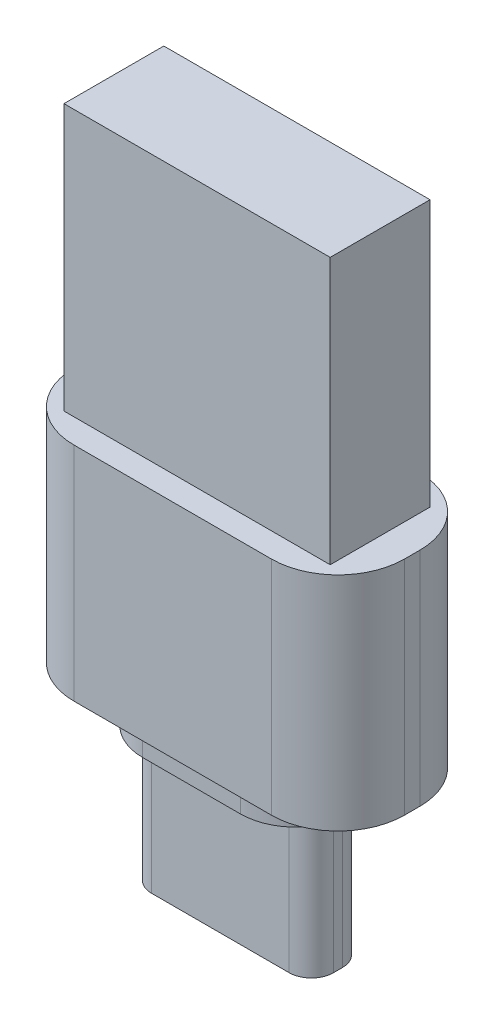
ISO-10303-21;
HEADER;
FILE_DESCRIPTION(('STEP AP214'),'2;1');
FILE_NAME('part.step','',(''),(''),'','','');
FILE_SCHEMA(('AUTOMOTIVE_DESIGN { 1 0 10303 214 1 1 1 1 }'));
ENDSEC;
DATA;
#1=APPLICATION_CONTEXT('core data for automotive mechanical design processes');
#2=APPLICATION_PROTOCOL_DEFINITION('international standard','automotive_design',2000,#1);
#3=PRODUCT_CONTEXT('',#1,'mechanical');
#4=PRODUCT('Part','Part','',(#3));
#5=PRODUCT_RELATED_PRODUCT_CATEGORY('part','',(#4));
#6=PRODUCT_DEFINITION_FORMATION('','',#4);
#7=PRODUCT_DEFINITION_CONTEXT('part definition',#1,'design');
#8=PRODUCT_DEFINITION('design','',#6,#7);
#9=PRODUCT_DEFINITION_SHAPE('','',#8);
#10=(LENGTH_UNIT() NAMED_UNIT(*) SI_UNIT(.MILLI.,.METRE.));
#11=(NAMED_UNIT(*) PLANE_ANGLE_UNIT() SI_UNIT($,.RADIAN.));
#12=(NAMED_UNIT(*) SI_UNIT($,.STERADIAN.) SOLID_ANGLE_UNIT());
#13=UNCERTAINTY_MEASURE_WITH_UNIT(LENGTH_MEASURE(1.E-05),#10,'distance_accuracy_value','');
#14=(GEOMETRIC_REPRESENTATION_CONTEXT(3) GLOBAL_UNCERTAINTY_ASSIGNED_CONTEXT((#13)) GLOBAL_UNIT_ASSIGNED_CONTEXT((#10,
#11,#12)) REPRESENTATION_CONTEXT('',''));
#15=CARTESIAN_POINT('',(0.,0.,0.));
#16=DIRECTION('',(0.,0.,1.));
#17=DIRECTION('',(1.,0.,0.));
#18=AXIS2_PLACEMENT_3D('',#15,#16,#17);
#19=CARTESIAN_POINT('',(0.,-1.5,0.));
#20=DIRECTION('',(0.,1.,0.));
#21=DIRECTION('',(0.,0.,1.));
#22=AXIS2_PLACEMENT_3D('',#19,#20,#21);
#23=PLANE('',#22);
#24=CARTESIAN_POINT('',(-2.2,-1.5,0.));
#25=DIRECTION('',(0.,1.,0.));
#26=DIRECTION('',(0.,0.,1.));
#27=AXIS2_PLACEMENT_3D('',#24,#25,#26);
#28=CIRCLE('',#27,2.5);
#29=CARTESIAN_POINT('',(-2.2,-1.5,2.5));
#30=VERTEX_POINT('',#29);
#31=CARTESIAN_POINT('',(-4.7,-1.5,0.));
#32=VERTEX_POINT('',#31);
#33=EDGE_CURVE('E308',#30,#32,#28,.F.);
#34=ORIENTED_EDGE('',*,*,#33,.T.);
#35=CARTESIAN_POINT('',(-2.2,-1.5,0.));
#36=DIRECTION('',(0.,1.,0.));
#37=DIRECTION('',(0.,0.,1.));
#38=AXIS2_PLACEMENT_3D('',#35,#36,#37);
#39=CIRCLE('',#38,2.5);
#40=CARTESIAN_POINT('',(-2.2,-1.5,-2.5));
#41=VERTEX_POINT('',#40);
#42=EDGE_CURVE('E310',#32,#41,#39,.F.);
#43=ORIENTED_EDGE('',*,*,#42,.T.);
#44=DIRECTION('',(1.,0.,0.));
#45=VECTOR('',#44,1.);
#46=CARTESIAN_POINT('',(4.7,-1.5,-2.5));
#47=LINE('',#46,#45);
#48=CARTESIAN_POINT('',(2.2,-1.5,-2.5));
#49=VERTEX_POINT('',#48);
#50=EDGE_CURVE('E400',#41,#49,#47,.T.);
#51=ORIENTED_EDGE('',*,*,#50,.T.);
#52=CARTESIAN_POINT('',(2.2,-1.5,0.));
#53=DIRECTION('',(0.,1.,0.));
#54=DIRECTION('',(0.,0.,1.));
#55=AXIS2_PLACEMENT_3D('',#52,#53,#54);
#56=CIRCLE('',#55,2.5);
#57=CARTESIAN_POINT('',(4.7,-1.5,0.));
#58=VERTEX_POINT('',#57);
#59=EDGE_CURVE('E304',#49,#58,#56,.F.);
#60=ORIENTED_EDGE('',*,*,#59,.T.);
#61=CARTESIAN_POINT('',(2.2,-1.5,0.));
#62=DIRECTION('',(0.,1.,0.));
#63=DIRECTION('',(0.,0.,1.));
#64=AXIS2_PLACEMENT_3D('',#61,#62,#63);
#65=CIRCLE('',#64,2.5);
#66=CARTESIAN_POINT('',(2.2,-1.5,2.5));
#67=VERTEX_POINT('',#66);
#68=EDGE_CURVE('E306',#58,#67,#65,.F.);
#69=ORIENTED_EDGE('',*,*,#68,.T.);
#70=DIRECTION('',(-1.,0.,0.));
#71=VECTOR('',#70,1.);
#72=CARTESIAN_POINT('',(4.7,-1.5,2.5));
#73=LINE('',#72,#71);
#74=EDGE_CURVE('E403',#67,#30,#73,.T.);
#75=ORIENTED_EDGE('',*,*,#74,.T.);
#76=EDGE_LOOP('',(#34,#43,#51,#60,#69,#75));
#77=FACE_BOUND('',#76,.T.);
#78=DIRECTION('',(0.,0.,-1.));
#79=VECTOR('',#78,1.);
#80=CARTESIAN_POINT('',(-4.1,-1.5,1.2));
#81=LINE('',#80,#79);
#82=CARTESIAN_POINT('',(-4.1,-1.5,0.199999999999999));
#83=VERTEX_POINT('',#82);
#84=CARTESIAN_POINT('',(-4.1,-1.5,-0.200000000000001));
#85=VERTEX_POINT('',#84);
#86=EDGE_CURVE('E329',#83,#85,#81,.T.);
#87=ORIENTED_EDGE('',*,*,#86,.F.);
#88=CARTESIAN_POINT('',(-3.1,-1.5,0.199999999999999));
#89=DIRECTION('',(0.,1.,0.));
#90=DIRECTION('',(0.,0.,1.));
#91=AXIS2_PLACEMENT_3D('',#88,#89,#90);
#92=CIRCLE('',#91,1.);
#93=CARTESIAN_POINT('',(-3.1,-1.5,1.2));
#94=VERTEX_POINT('',#93);
#95=EDGE_CURVE('E45',#83,#94,#92,.T.);
#96=ORIENTED_EDGE('',*,*,#95,.T.);
#97=DIRECTION('',(-1.,0.,0.));
#98=VECTOR('',#97,1.);
#99=CARTESIAN_POINT('',(4.1,-1.5,1.2));
#100=LINE('',#99,#98);
#101=CARTESIAN_POINT('',(3.1,-1.5,1.2));
#102=VERTEX_POINT('',#101);
#103=EDGE_CURVE('E364',#102,#94,#100,.T.);
#104=ORIENTED_EDGE('',*,*,#103,.F.);
#105=CARTESIAN_POINT('',(3.1,-1.5,0.2));
#106=DIRECTION('',(0.,1.,0.));
#107=DIRECTION('',(0.,0.,1.));
#108=AXIS2_PLACEMENT_3D('',#105,#106,#107);
#109=CIRCLE('',#108,1.);
#110=CARTESIAN_POINT('',(4.1,-1.5,0.2));
#111=VERTEX_POINT('',#110);
#112=EDGE_CURVE('E361',#102,#111,#109,.T.);
#113=ORIENTED_EDGE('',*,*,#112,.T.);
#114=DIRECTION('',(0.,0.,1.));
#115=VECTOR('',#114,1.);
#116=CARTESIAN_POINT('',(4.1,-1.5,1.2));
#117=LINE('',#116,#115);
#118=CARTESIAN_POINT('',(4.1,-1.5,-0.2));
#119=VERTEX_POINT('',#118);
#120=EDGE_CURVE('E371',#119,#111,#117,.T.);
#121=ORIENTED_EDGE('',*,*,#120,.F.);
#122=CARTESIAN_POINT('',(3.1,-1.5,-0.2));
#123=DIRECTION('',(0.,1.,0.));
#124=DIRECTION('',(0.,0.,1.));
#125=AXIS2_PLACEMENT_3D('',#122,#123,#124);
#126=CIRCLE('',#125,1.);
#127=CARTESIAN_POINT('',(3.1,-1.5,-1.2));
#128=VERTEX_POINT('',#127);
#129=EDGE_CURVE('E359',#119,#128,#126,.T.);
#130=ORIENTED_EDGE('',*,*,#129,.T.);
#131=DIRECTION('',(1.,0.,0.));
#132=VECTOR('',#131,1.);
#133=CARTESIAN_POINT('',(4.1,-1.5,-1.2));
#134=LINE('',#133,#132);
#135=CARTESIAN_POINT('',(-3.1,-1.5,-1.2));
#136=VERTEX_POINT('',#135);
#137=EDGE_CURVE('E395',#136,#128,#134,.T.);
#138=ORIENTED_EDGE('',*,*,#137,.F.);
#139=CARTESIAN_POINT('',(-3.1,-1.5,-0.2));
#140=DIRECTION('',(0.,1.,0.));
#141=DIRECTION('',(0.,0.,1.));
#142=AXIS2_PLACEMENT_3D('',#139,#140,#141);
#143=CIRCLE('',#142,1.);
#144=EDGE_CURVE('E11',#136,#85,#143,.T.);
#145=ORIENTED_EDGE('',*,*,#144,.T.);
#146=EDGE_LOOP('',(#87,#96,#104,#113,#121,#130,#138,#145));
#147=FACE_BOUND('',#146,.T.);
#148=ADVANCED_FACE('F37',(#77,#147),#23,.F.);
#149=CARTESIAN_POINT('',(0.,10.,0.));
#150=DIRECTION('',(0.,-1.,0.));
#151=DIRECTION('',(0.,0.,-1.));
#152=AXIS2_PLACEMENT_3D('',#149,#150,#151);
#153=PLANE('',#152);
#154=DIRECTION('',(1.,0.,0.));
#155=VECTOR('',#154,1.);
#156=CARTESIAN_POINT('',(-7.44999999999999,10.,3.35));
#157=LINE('',#156,#155);
#158=CARTESIAN_POINT('',(-4.44999999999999,10.,3.35));
#159=VERTEX_POINT('',#158);
#160=CARTESIAN_POINT('',(4.45,10.,3.35));
#161=VERTEX_POINT('',#160);
#162=EDGE_CURVE('E253',#159,#161,#157,.T.);
#163=ORIENTED_EDGE('',*,*,#162,.T.);
#164=CARTESIAN_POINT('',(4.45,10.,0.35));
#165=DIRECTION('',(0.,-1.,0.));
#166=DIRECTION('',(0.,0.,-1.));
#167=AXIS2_PLACEMENT_3D('',#164,#165,#166);
#168=CIRCLE('',#167,3.);
#169=CARTESIAN_POINT('',(7.45,10.,0.35));
#170=VERTEX_POINT('',#169);
#171=EDGE_CURVE('E287',#161,#170,#168,.F.);
#172=ORIENTED_EDGE('',*,*,#171,.T.);
#173=DIRECTION('',(0.,0.,-1.));
#174=VECTOR('',#173,1.);
#175=CARTESIAN_POINT('',(7.45,10.,3.35));
#176=LINE('',#175,#174);
#177=CARTESIAN_POINT('',(7.45,10.,-0.35));
#178=VERTEX_POINT('',#177);
#179=EDGE_CURVE('E243',#170,#178,#176,.T.);
#180=ORIENTED_EDGE('',*,*,#179,.T.);
#181=CARTESIAN_POINT('',(4.45,10.,-0.35));
#182=DIRECTION('',(0.,-1.,0.));
#183=DIRECTION('',(0.,0.,-1.));
#184=AXIS2_PLACEMENT_3D('',#181,#182,#183);
#185=CIRCLE('',#184,3.);
#186=CARTESIAN_POINT('',(4.45,10.,-3.35));
#187=VERTEX_POINT('',#186);
#188=EDGE_CURVE('E281',#178,#187,#185,.F.);
#189=ORIENTED_EDGE('',*,*,#188,.T.);
#190=DIRECTION('',(-1.,0.,0.));
#191=VECTOR('',#190,1.);
#192=CARTESIAN_POINT('',(-7.44999999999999,10.,-3.35));
#193=LINE('',#192,#191);
#194=CARTESIAN_POINT('',(-4.44999999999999,10.,-3.35));
#195=VERTEX_POINT('',#194);
#196=EDGE_CURVE('E246',#187,#195,#193,.T.);
#197=ORIENTED_EDGE('',*,*,#196,.T.);
#198=CARTESIAN_POINT('',(-4.44999999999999,10.,-0.35));
#199=DIRECTION('',(0.,-1.,0.));
#200=DIRECTION('',(0.,0.,-1.));
#201=AXIS2_PLACEMENT_3D('',#198,#199,#200);
#202=CIRCLE('',#201,3.);
#203=CARTESIAN_POINT('',(-7.44999999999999,10.,-0.35));
#204=VERTEX_POINT('',#203);
#205=EDGE_CURVE('E283',#195,#204,#202,.F.);
#206=ORIENTED_EDGE('',*,*,#205,.T.);
#207=DIRECTION('',(0.,0.,1.));
#208=VECTOR('',#207,1.);
#209=CARTESIAN_POINT('',(-7.44999999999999,10.,3.35));
#210=LINE('',#209,#208);
#211=CARTESIAN_POINT('',(-7.44999999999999,10.,0.35));
#212=VERTEX_POINT('',#211);
#213=EDGE_CURVE('E250',#204,#212,#210,.T.);
#214=ORIENTED_EDGE('',*,*,#213,.T.);
#215=CARTESIAN_POINT('',(-4.44999999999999,10.,0.35));
#216=DIRECTION('',(0.,-1.,0.));
#217=DIRECTION('',(0.,0.,-1.));
#218=AXIS2_PLACEMENT_3D('',#215,#216,#217);
#219=CIRCLE('',#218,3.);
#220=EDGE_CURVE('E285',#212,#159,#219,.F.);
#221=ORIENTED_EDGE('',*,*,#220,.T.);
#222=EDGE_LOOP('',(#163,#172,#180,#189,#197,#206,#214,#221));
#223=FACE_BOUND('',#222,.T.);
#224=DIRECTION('',(0.,0.,-1.));
#225=VECTOR('',#224,1.);
#226=CARTESIAN_POINT('',(6.,10.,2.25));
#227=LINE('',#226,#225);
#228=CARTESIAN_POINT('',(6.,10.,2.25));
#229=VERTEX_POINT('',#228);
#230=CARTESIAN_POINT('',(6.,10.,-2.25000000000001));
#231=VERTEX_POINT('',#230);
#232=EDGE_CURVE('E233',#229,#231,#227,.T.);
#233=ORIENTED_EDGE('',*,*,#232,.F.);
#234=DIRECTION('',(1.,0.,0.));
#235=VECTOR('',#234,1.);
#236=CARTESIAN_POINT('',(-6.,10.,2.25));
#237=LINE('',#236,#235);
#238=CARTESIAN_POINT('',(-6.,10.,2.25));
#239=VERTEX_POINT('',#238);
#240=EDGE_CURVE('E230',#239,#229,#237,.T.);
#241=ORIENTED_EDGE('',*,*,#240,.F.);
#242=DIRECTION('',(0.,0.,1.));
#243=VECTOR('',#242,1.);
#244=CARTESIAN_POINT('',(-6.,10.,2.25));
#245=LINE('',#244,#243);
#246=CARTESIAN_POINT('',(-6.,10.,-2.25000000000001));
#247=VERTEX_POINT('',#246);
#248=EDGE_CURVE('E417',#247,#239,#245,.T.);
#249=ORIENTED_EDGE('',*,*,#248,.F.);
#250=DIRECTION('',(-1.,0.,0.));
#251=VECTOR('',#250,1.);
#252=CARTESIAN_POINT('',(-6.,10.,-2.25000000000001));
#253=LINE('',#252,#251);
#254=EDGE_CURVE('E415',#231,#247,#253,.T.);
#255=ORIENTED_EDGE('',*,*,#254,.F.);
#256=EDGE_LOOP('',(#233,#241,#249,#255));
#257=FACE_BOUND('',#256,.T.);
#258=ADVANCED_FACE('F429',(#223,#257),#153,.F.);
#259=CARTESIAN_POINT('',(7.45,10.,3.35));
#260=DIRECTION('',(-1.,0.,0.));
#261=DIRECTION('',(0.,0.,1.));
#262=AXIS2_PLACEMENT_3D('',#259,#260,#261);
#263=PLANE('',#262);
#264=ORIENTED_EDGE('',*,*,#179,.F.);
#265=DIRECTION('',(0.,-1.,0.));
#266=VECTOR('',#265,1.);
#267=CARTESIAN_POINT('',(7.45,10.,0.35));
#268=LINE('',#267,#266);
#269=CARTESIAN_POINT('',(7.45,0.,0.35));
#270=VERTEX_POINT('',#269);
#271=EDGE_CURVE('E265',#170,#270,#268,.T.);
#272=ORIENTED_EDGE('',*,*,#271,.T.);
#273=DIRECTION('',(0.,0.,-1.));
#274=VECTOR('',#273,1.);
#275=CARTESIAN_POINT('',(7.45,0.,3.35));
#276=LINE('',#275,#274);
#277=CARTESIAN_POINT('',(7.45,0.,-0.35));
#278=VERTEX_POINT('',#277);
#279=EDGE_CURVE('E234',#270,#278,#276,.T.);
#280=ORIENTED_EDGE('',*,*,#279,.T.);
#281=DIRECTION('',(0.,-1.,0.));
#282=VECTOR('',#281,1.);
#283=CARTESIAN_POINT('',(7.45,10.,-0.35));
#284=LINE('',#283,#282);
#285=EDGE_CURVE('E255',#278,#178,#284,.F.);
#286=ORIENTED_EDGE('',*,*,#285,.T.);
#287=EDGE_LOOP('',(#264,#272,#280,#286));
#288=FACE_BOUND('',#287,.T.);
#289=ADVANCED_FACE('F431',(#288),#263,.F.);
#290=CARTESIAN_POINT('',(-7.44999999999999,10.,-3.35));
#291=DIRECTION('',(0.,0.,1.));
#292=DIRECTION('',(1.,0.,0.));
#293=AXIS2_PLACEMENT_3D('',#290,#291,#292);
#294=PLANE('',#293);
#295=DIRECTION('',(-1.,0.,0.));
#296=VECTOR('',#295,1.);
#297=CARTESIAN_POINT('',(-7.44999999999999,0.,-3.35));
#298=LINE('',#297,#296);
#299=CARTESIAN_POINT('',(4.45,0.,-3.35));
#300=VERTEX_POINT('',#299);
#301=CARTESIAN_POINT('',(-4.44999999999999,0.,-3.35));
#302=VERTEX_POINT('',#301);
#303=EDGE_CURVE('E237',#300,#302,#298,.T.);
#304=ORIENTED_EDGE('',*,*,#303,.T.);
#305=DIRECTION('',(0.,-1.,0.));
#306=VECTOR('',#305,1.);
#307=CARTESIAN_POINT('',(-4.44999999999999,10.,-3.35));
#308=LINE('',#307,#306);
#309=EDGE_CURVE('E297',#302,#195,#308,.F.);
#310=ORIENTED_EDGE('',*,*,#309,.T.);
#311=ORIENTED_EDGE('',*,*,#196,.F.);
#312=DIRECTION('',(0.,-1.,0.));
#313=VECTOR('',#312,1.);
#314=CARTESIAN_POINT('',(4.45,10.,-3.35));
#315=LINE('',#314,#313);
#316=EDGE_CURVE('E294',#187,#300,#315,.T.);
#317=ORIENTED_EDGE('',*,*,#316,.T.);
#318=EDGE_LOOP('',(#304,#310,#311,#317));
#319=FACE_BOUND('',#318,.T.);
#320=ADVANCED_FACE('F438',(#319),#294,.F.);
#321=CARTESIAN_POINT('',(-7.44999999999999,10.,3.35));
#322=DIRECTION('',(1.,0.,0.));
#323=DIRECTION('',(0.,0.,-1.));
#324=AXIS2_PLACEMENT_3D('',#321,#322,#323);
#325=PLANE('',#324);
#326=DIRECTION('',(0.,0.,1.));
#327=VECTOR('',#326,1.);
#328=CARTESIAN_POINT('',(-7.44999999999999,0.,3.35));
#329=LINE('',#328,#327);
#330=CARTESIAN_POINT('',(-7.44999999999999,0.,-0.35));
#331=VERTEX_POINT('',#330);
#332=CARTESIAN_POINT('',(-7.44999999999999,0.,0.35));
#333=VERTEX_POINT('',#332);
#334=EDGE_CURVE('E259',#331,#333,#329,.T.);
#335=ORIENTED_EDGE('',*,*,#334,.T.);
#336=DIRECTION('',(0.,-1.,0.));
#337=VECTOR('',#336,1.);
#338=CARTESIAN_POINT('',(-7.44999999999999,10.,0.35));
#339=LINE('',#338,#337);
#340=EDGE_CURVE('E292',#333,#212,#339,.F.);
#341=ORIENTED_EDGE('',*,*,#340,.T.);
#342=ORIENTED_EDGE('',*,*,#213,.F.);
#343=DIRECTION('',(0.,-1.,0.));
#344=VECTOR('',#343,1.);
#345=CARTESIAN_POINT('',(-7.44999999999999,10.,-0.35));
#346=LINE('',#345,#344);
#347=EDGE_CURVE('E289',#204,#331,#346,.T.);
#348=ORIENTED_EDGE('',*,*,#347,.T.);
#349=EDGE_LOOP('',(#335,#341,#342,#348));
#350=FACE_BOUND('',#349,.T.);
#351=ADVANCED_FACE('F453',(#350),#325,.F.);
#352=CARTESIAN_POINT('',(-7.44999999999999,10.,3.35));
#353=DIRECTION('',(0.,0.,-1.));
#354=DIRECTION('',(-1.,0.,0.));
#355=AXIS2_PLACEMENT_3D('',#352,#353,#354);
#356=PLANE('',#355);
#357=DIRECTION('',(1.,0.,0.));
#358=VECTOR('',#357,1.);
#359=CARTESIAN_POINT('',(-7.44999999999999,0.,3.35));
#360=LINE('',#359,#358);
#361=CARTESIAN_POINT('',(-4.44999999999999,0.,3.35));
#362=VERTEX_POINT('',#361);
#363=CARTESIAN_POINT('',(4.45,0.,3.35));
#364=VERTEX_POINT('',#363);
#365=EDGE_CURVE('E247',#362,#364,#360,.T.);
#366=ORIENTED_EDGE('',*,*,#365,.T.);
#367=DIRECTION('',(0.,-1.,0.));
#368=VECTOR('',#367,1.);
#369=CARTESIAN_POINT('',(4.45,10.,3.35));
#370=LINE('',#369,#368);
#371=EDGE_CURVE('E279',#364,#161,#370,.F.);
#372=ORIENTED_EDGE('',*,*,#371,.T.);
#373=ORIENTED_EDGE('',*,*,#162,.F.);
#374=DIRECTION('',(0.,-1.,0.));
#375=VECTOR('',#374,1.);
#376=CARTESIAN_POINT('',(-4.44999999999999,10.,3.35));
#377=LINE('',#376,#375);
#378=EDGE_CURVE('E276',#159,#362,#377,.T.);
#379=ORIENTED_EDGE('',*,*,#378,.T.);
#380=EDGE_LOOP('',(#366,#372,#373,#379));
#381=FACE_BOUND('',#380,.T.);
#382=ADVANCED_FACE('F449',(#381),#356,.F.);
#383=CARTESIAN_POINT('',(0.,0.,0.));
#384=DIRECTION('',(0.,-1.,0.));
#385=DIRECTION('',(0.,0.,-1.));
#386=AXIS2_PLACEMENT_3D('',#383,#384,#385);
#387=PLANE('',#386);
#388=CARTESIAN_POINT('',(-2.2,0.,0.));
#389=DIRECTION('',(0.,-1.,0.));
#390=DIRECTION('',(0.,0.,-1.));
#391=AXIS2_PLACEMENT_3D('',#388,#389,#390);
#392=CIRCLE('',#391,2.5);
#393=CARTESIAN_POINT('',(-2.2,0.,-2.5));
#394=VERTEX_POINT('',#393);
#395=CARTESIAN_POINT('',(-4.7,0.,0.));
#396=VERTEX_POINT('',#395);
#397=EDGE_CURVE('E317',#394,#396,#392,.F.);
#398=ORIENTED_EDGE('',*,*,#397,.T.);
#399=CARTESIAN_POINT('',(-2.2,0.,0.));
#400=DIRECTION('',(0.,-1.,0.));
#401=DIRECTION('',(0.,0.,-1.));
#402=AXIS2_PLACEMENT_3D('',#399,#400,#401);
#403=CIRCLE('',#402,2.5);
#404=CARTESIAN_POINT('',(-2.2,0.,2.5));
#405=VERTEX_POINT('',#404);
#406=EDGE_CURVE('E319',#396,#405,#403,.F.);
#407=ORIENTED_EDGE('',*,*,#406,.T.);
#408=DIRECTION('',(-1.,0.,0.));
#409=VECTOR('',#408,1.);
#410=CARTESIAN_POINT('',(4.7,0.,2.5));
#411=LINE('',#410,#409);
#412=CARTESIAN_POINT('',(2.2,0.,2.5));
#413=VERTEX_POINT('',#412);
#414=EDGE_CURVE('E404',#413,#405,#411,.T.);
#415=ORIENTED_EDGE('',*,*,#414,.F.);
#416=CARTESIAN_POINT('',(2.2,0.,0.));
#417=DIRECTION('',(0.,-1.,0.));
#418=DIRECTION('',(0.,0.,-1.));
#419=AXIS2_PLACEMENT_3D('',#416,#417,#418);
#420=CIRCLE('',#419,2.5);
#421=CARTESIAN_POINT('',(4.7,0.,0.));
#422=VERTEX_POINT('',#421);
#423=EDGE_CURVE('E321',#413,#422,#420,.F.);
#424=ORIENTED_EDGE('',*,*,#423,.T.);
#425=CARTESIAN_POINT('',(2.2,0.,0.));
#426=DIRECTION('',(0.,-1.,0.));
#427=DIRECTION('',(0.,0.,-1.));
#428=AXIS2_PLACEMENT_3D('',#425,#426,#427);
#429=CIRCLE('',#428,2.5);
#430=CARTESIAN_POINT('',(2.2,0.,-2.5));
#431=VERTEX_POINT('',#430);
#432=EDGE_CURVE('E323',#422,#431,#429,.F.);
#433=ORIENTED_EDGE('',*,*,#432,.T.);
#434=DIRECTION('',(1.,0.,0.));
#435=VECTOR('',#434,1.);
#436=CARTESIAN_POINT('',(4.7,0.,-2.5));
#437=LINE('',#436,#435);
#438=EDGE_CURVE('E393',#394,#431,#437,.T.);
#439=ORIENTED_EDGE('',*,*,#438,.F.);
#440=EDGE_LOOP('',(#398,#407,#415,#424,#433,#439));
#441=FACE_BOUND('',#440,.T.);
#442=ORIENTED_EDGE('',*,*,#279,.F.);
#443=CARTESIAN_POINT('',(4.45,0.,0.35));
#444=DIRECTION('',(0.,-1.,0.));
#445=DIRECTION('',(0.,0.,-1.));
#446=AXIS2_PLACEMENT_3D('',#443,#444,#445);
#447=CIRCLE('',#446,3.);
#448=EDGE_CURVE('E274',#270,#364,#447,.T.);
#449=ORIENTED_EDGE('',*,*,#448,.T.);
#450=ORIENTED_EDGE('',*,*,#365,.F.);
#451=CARTESIAN_POINT('',(-4.44999999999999,0.,0.35));
#452=DIRECTION('',(0.,-1.,0.));
#453=DIRECTION('',(0.,0.,-1.));
#454=AXIS2_PLACEMENT_3D('',#451,#452,#453);
#455=CIRCLE('',#454,3.);
#456=EDGE_CURVE('E272',#362,#333,#455,.T.);
#457=ORIENTED_EDGE('',*,*,#456,.T.);
#458=ORIENTED_EDGE('',*,*,#334,.F.);
#459=CARTESIAN_POINT('',(-4.44999999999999,0.,-0.35));
#460=DIRECTION('',(0.,-1.,0.));
#461=DIRECTION('',(0.,0.,-1.));
#462=AXIS2_PLACEMENT_3D('',#459,#460,#461);
#463=CIRCLE('',#462,3.);
#464=EDGE_CURVE('E270',#331,#302,#463,.T.);
#465=ORIENTED_EDGE('',*,*,#464,.T.);
#466=ORIENTED_EDGE('',*,*,#303,.F.);
#467=CARTESIAN_POINT('',(4.45,0.,-0.35));
#468=DIRECTION('',(0.,-1.,0.));
#469=DIRECTION('',(0.,0.,-1.));
#470=AXIS2_PLACEMENT_3D('',#467,#468,#469);
#471=CIRCLE('',#470,3.);
#472=EDGE_CURVE('E268',#300,#278,#471,.T.);
#473=ORIENTED_EDGE('',*,*,#472,.T.);
#474=EDGE_LOOP('',(#442,#449,#450,#457,#458,#465,#466,#473));
#475=FACE_BOUND('',#474,.T.);
#476=ADVANCED_FACE('F446',(#441,#475),#387,.T.);
#477=CARTESIAN_POINT('',(6.,22.,2.25));
#478=DIRECTION('',(-1.,0.,0.));
#479=DIRECTION('',(0.,0.,1.));
#480=AXIS2_PLACEMENT_3D('',#477,#478,#479);
#481=PLANE('',#480);
#482=ORIENTED_EDGE('',*,*,#232,.T.);
#483=DIRECTION('',(0.,-1.,0.));
#484=VECTOR('',#483,1.);
#485=CARTESIAN_POINT('',(6.,22.,-2.25000000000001));
#486=LINE('',#485,#484);
#487=CARTESIAN_POINT('',(6.,22.,-2.25000000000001));
#488=VERTEX_POINT('',#487);
#489=EDGE_CURVE('E214',#488,#231,#486,.T.);
#490=ORIENTED_EDGE('',*,*,#489,.F.);
#491=DIRECTION('',(0.,0.,-1.));
#492=VECTOR('',#491,1.);
#493=CARTESIAN_POINT('',(6.,22.,2.25));
#494=LINE('',#493,#492);
#495=CARTESIAN_POINT('',(6.,22.,2.25));
#496=VERTEX_POINT('',#495);
#497=EDGE_CURVE('E221',#496,#488,#494,.T.);
#498=ORIENTED_EDGE('',*,*,#497,.F.);
#499=DIRECTION('',(0.,-1.,0.));
#500=VECTOR('',#499,1.);
#501=CARTESIAN_POINT('',(6.,22.,2.25));
#502=LINE('',#501,#500);
#503=EDGE_CURVE('E413',#496,#229,#502,.T.);
#504=ORIENTED_EDGE('',*,*,#503,.T.);
#505=EDGE_LOOP('',(#482,#490,#498,#504));
#506=FACE_BOUND('',#505,.T.);
#507=ADVANCED_FACE('F232',(#506),#481,.F.);
#508=CARTESIAN_POINT('',(-6.,22.,-2.25000000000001));
#509=DIRECTION('',(0.,0.,1.));
#510=DIRECTION('',(1.,0.,0.));
#511=AXIS2_PLACEMENT_3D('',#508,#509,#510);
#512=PLANE('',#511);
#513=ORIENTED_EDGE('',*,*,#254,.T.);
#514=DIRECTION('',(0.,-1.,0.));
#515=VECTOR('',#514,1.);
#516=CARTESIAN_POINT('',(-6.,22.,-2.25000000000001));
#517=LINE('',#516,#515);
#518=CARTESIAN_POINT('',(-6.,22.,-2.25000000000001));
#519=VERTEX_POINT('',#518);
#520=EDGE_CURVE('E217',#519,#247,#517,.T.);
#521=ORIENTED_EDGE('',*,*,#520,.F.);
#522=DIRECTION('',(-1.,0.,0.));
#523=VECTOR('',#522,1.);
#524=CARTESIAN_POINT('',(-6.,22.,-2.25000000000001));
#525=LINE('',#524,#523);
#526=EDGE_CURVE('E209',#488,#519,#525,.T.);
#527=ORIENTED_EDGE('',*,*,#526,.F.);
#528=ORIENTED_EDGE('',*,*,#489,.T.);
#529=EDGE_LOOP('',(#513,#521,#527,#528));
#530=FACE_BOUND('',#529,.T.);
#531=ADVANCED_FACE('F212',(#530),#512,.F.);
#532=CARTESIAN_POINT('',(-6.,22.,2.25));
#533=DIRECTION('',(1.,0.,0.));
#534=DIRECTION('',(0.,0.,-1.));
#535=AXIS2_PLACEMENT_3D('',#532,#533,#534);
#536=PLANE('',#535);
#537=ORIENTED_EDGE('',*,*,#248,.T.);
#538=DIRECTION('',(0.,-1.,0.));
#539=VECTOR('',#538,1.);
#540=CARTESIAN_POINT('',(-6.,22.,2.25));
#541=LINE('',#540,#539);
#542=CARTESIAN_POINT('',(-6.,22.,2.25));
#543=VERTEX_POINT('',#542);
#544=EDGE_CURVE('E239',#543,#239,#541,.T.);
#545=ORIENTED_EDGE('',*,*,#544,.F.);
#546=DIRECTION('',(0.,0.,1.));
#547=VECTOR('',#546,1.);
#548=CARTESIAN_POINT('',(-6.,22.,2.25));
#549=LINE('',#548,#547);
#550=EDGE_CURVE('E220',#519,#543,#549,.T.);
#551=ORIENTED_EDGE('',*,*,#550,.F.);
#552=ORIENTED_EDGE('',*,*,#520,.T.);
#553=EDGE_LOOP('',(#537,#545,#551,#552));
#554=FACE_BOUND('',#553,.T.);
#555=ADVANCED_FACE('F427',(#554),#536,.F.);
#556=CARTESIAN_POINT('',(-6.,22.,2.25));
#557=DIRECTION('',(0.,0.,-1.));
#558=DIRECTION('',(-1.,0.,0.));
#559=AXIS2_PLACEMENT_3D('',#556,#557,#558);
#560=PLANE('',#559);
#561=ORIENTED_EDGE('',*,*,#240,.T.);
#562=ORIENTED_EDGE('',*,*,#503,.F.);
#563=DIRECTION('',(1.,0.,0.));
#564=VECTOR('',#563,1.);
#565=CARTESIAN_POINT('',(-6.,22.,2.25));
#566=LINE('',#565,#564);
#567=EDGE_CURVE('E226',#543,#496,#566,.T.);
#568=ORIENTED_EDGE('',*,*,#567,.F.);
#569=ORIENTED_EDGE('',*,*,#544,.T.);
#570=EDGE_LOOP('',(#561,#562,#568,#569));
#571=FACE_BOUND('',#570,.T.);
#572=ADVANCED_FACE('F425',(#571),#560,.F.);
#573=CARTESIAN_POINT('',(0.,22.,0.));
#574=DIRECTION('',(0.,-1.,0.));
#575=DIRECTION('',(0.,0.,-1.));
#576=AXIS2_PLACEMENT_3D('',#573,#574,#575);
#577=PLANE('',#576);
#578=ORIENTED_EDGE('',*,*,#497,.T.);
#579=ORIENTED_EDGE('',*,*,#526,.T.);
#580=ORIENTED_EDGE('',*,*,#550,.T.);
#581=ORIENTED_EDGE('',*,*,#567,.T.);
#582=EDGE_LOOP('',(#578,#579,#580,#581));
#583=FACE_BOUND('',#582,.T.);
#584=ADVANCED_FACE('F224',(#583),#577,.F.);
#585=CARTESIAN_POINT('',(4.7,-1.5,-2.5));
#586=DIRECTION('',(0.,0.,1.));
#587=DIRECTION('',(1.,0.,0.));
#588=AXIS2_PLACEMENT_3D('',#585,#586,#587);
#589=PLANE('',#588);
#590=ORIENTED_EDGE('',*,*,#50,.F.);
#591=DIRECTION('',(0.,1.,0.));
#592=VECTOR('',#591,1.);
#593=CARTESIAN_POINT('',(-2.2,-1.5,-2.5));
#594=LINE('',#593,#592);
#595=EDGE_CURVE('E301',#41,#394,#594,.T.);
#596=ORIENTED_EDGE('',*,*,#595,.T.);
#597=ORIENTED_EDGE('',*,*,#438,.T.);
#598=DIRECTION('',(0.,1.,0.));
#599=VECTOR('',#598,1.);
#600=CARTESIAN_POINT('',(2.2,-1.5,-2.5));
#601=LINE('',#600,#599);
#602=EDGE_CURVE('E299',#431,#49,#601,.F.);
#603=ORIENTED_EDGE('',*,*,#602,.T.);
#604=EDGE_LOOP('',(#590,#596,#597,#603));
#605=FACE_BOUND('',#604,.T.);
#606=ADVANCED_FACE('F535',(#605),#589,.F.);
#607=CARTESIAN_POINT('',(4.7,-1.5,2.5));
#608=DIRECTION('',(0.,0.,-1.));
#609=DIRECTION('',(-1.,0.,0.));
#610=AXIS2_PLACEMENT_3D('',#607,#608,#609);
#611=PLANE('',#610);
#612=ORIENTED_EDGE('',*,*,#414,.T.);
#613=DIRECTION('',(0.,1.,0.));
#614=VECTOR('',#613,1.);
#615=CARTESIAN_POINT('',(-2.2,-1.5,2.5));
#616=LINE('',#615,#614);
#617=EDGE_CURVE('E315',#405,#30,#616,.F.);
#618=ORIENTED_EDGE('',*,*,#617,.T.);
#619=ORIENTED_EDGE('',*,*,#74,.F.);
#620=DIRECTION('',(0.,1.,0.));
#621=VECTOR('',#620,1.);
#622=CARTESIAN_POINT('',(2.2,-1.5,2.5));
#623=LINE('',#622,#621);
#624=EDGE_CURVE('E312',#67,#413,#623,.T.);
#625=ORIENTED_EDGE('',*,*,#624,.T.);
#626=EDGE_LOOP('',(#612,#618,#619,#625));
#627=FACE_BOUND('',#626,.T.);
#628=ADVANCED_FACE('F531',(#627),#611,.F.);
#629=CARTESIAN_POINT('',(-4.1,-7.9,1.2));
#630=DIRECTION('',(1.,0.,0.));
#631=DIRECTION('',(0.,0.,-1.));
#632=AXIS2_PLACEMENT_3D('',#629,#630,#631);
#633=PLANE('',#632);
#634=DIRECTION('',(0.,0.,-1.));
#635=VECTOR('',#634,1.);
#636=CARTESIAN_POINT('',(-4.1,-7.9,1.2));
#637=LINE('',#636,#635);
#638=CARTESIAN_POINT('',(-4.1,-7.9,0.199999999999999));
#639=VERTEX_POINT('',#638);
#640=CARTESIAN_POINT('',(-4.1,-7.9,-0.200000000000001));
#641=VERTEX_POINT('',#640);
#642=EDGE_CURVE('E370',#639,#641,#637,.T.);
#643=ORIENTED_EDGE('',*,*,#642,.F.);
#644=DIRECTION('',(0.,1.,0.));
#645=VECTOR('',#644,1.);
#646=CARTESIAN_POINT('',(-4.1,-7.9,0.199999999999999));
#647=LINE('',#646,#645);
#648=EDGE_CURVE('E357',#639,#83,#647,.T.);
#649=ORIENTED_EDGE('',*,*,#648,.T.);
#650=ORIENTED_EDGE('',*,*,#86,.T.);
#651=DIRECTION('',(0.,1.,0.));
#652=VECTOR('',#651,1.);
#653=CARTESIAN_POINT('',(-4.1,-7.9,-0.200000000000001));
#654=LINE('',#653,#652);
#655=EDGE_CURVE('E355',#85,#641,#654,.F.);
#656=ORIENTED_EDGE('',*,*,#655,.T.);
#657=EDGE_LOOP('',(#643,#649,#650,#656));
#658=FACE_BOUND('',#657,.T.);
#659=ADVANCED_FACE('F383',(#658),#633,.F.);
#660=CARTESIAN_POINT('',(4.1,-7.9,-1.2));
#661=DIRECTION('',(0.,0.,1.));
#662=DIRECTION('',(1.,0.,0.));
#663=AXIS2_PLACEMENT_3D('',#660,#661,#662);
#664=PLANE('',#663);
#665=ORIENTED_EDGE('',*,*,#137,.T.);
#666=DIRECTION('',(0.,1.,0.));
#667=VECTOR('',#666,1.);
#668=CARTESIAN_POINT('',(3.1,-7.9,-1.2));
#669=LINE('',#668,#667);
#670=CARTESIAN_POINT('',(3.1,-7.9,-1.2));
#671=VERTEX_POINT('',#670);
#672=EDGE_CURVE('E340',#128,#671,#669,.F.);
#673=ORIENTED_EDGE('',*,*,#672,.T.);
#674=DIRECTION('',(1.,0.,0.));
#675=VECTOR('',#674,1.);
#676=CARTESIAN_POINT('',(4.1,-7.9,-1.2));
#677=LINE('',#676,#675);
#678=CARTESIAN_POINT('',(-3.1,-7.9,-1.2));
#679=VERTEX_POINT('',#678);
#680=EDGE_CURVE('E385',#679,#671,#677,.T.);
#681=ORIENTED_EDGE('',*,*,#680,.F.);
#682=DIRECTION('',(0.,1.,0.));
#683=VECTOR('',#682,1.);
#684=CARTESIAN_POINT('',(-3.1,-7.9,-1.2));
#685=LINE('',#684,#683);
#686=EDGE_CURVE('E337',#679,#136,#685,.T.);
#687=ORIENTED_EDGE('',*,*,#686,.T.);
#688=EDGE_LOOP('',(#665,#673,#681,#687));
#689=FACE_BOUND('',#688,.T.);
#690=ADVANCED_FACE('F511',(#689),#664,.F.);
#691=CARTESIAN_POINT('',(4.1,-7.9,1.2));
#692=DIRECTION('',(-1.,0.,0.));
#693=DIRECTION('',(0.,0.,1.));
#694=AXIS2_PLACEMENT_3D('',#691,#692,#693);
#695=PLANE('',#694);
#696=DIRECTION('',(0.,0.,1.));
#697=VECTOR('',#696,1.);
#698=CARTESIAN_POINT('',(4.1,-7.9,1.2));
#699=LINE('',#698,#697);
#700=CARTESIAN_POINT('',(4.1,-7.9,-0.2));
#701=VERTEX_POINT('',#700);
#702=CARTESIAN_POINT('',(4.1,-7.9,0.2));
#703=VERTEX_POINT('',#702);
#704=EDGE_CURVE('E387',#701,#703,#699,.T.);
#705=ORIENTED_EDGE('',*,*,#704,.F.);
#706=DIRECTION('',(0.,1.,0.));
#707=VECTOR('',#706,1.);
#708=CARTESIAN_POINT('',(4.1,-7.9,-0.2));
#709=LINE('',#708,#707);
#710=EDGE_CURVE('E334',#701,#119,#709,.T.);
#711=ORIENTED_EDGE('',*,*,#710,.T.);
#712=ORIENTED_EDGE('',*,*,#120,.T.);
#713=DIRECTION('',(0.,1.,0.));
#714=VECTOR('',#713,1.);
#715=CARTESIAN_POINT('',(4.1,-7.9,0.2));
#716=LINE('',#715,#714);
#717=EDGE_CURVE('E325',#111,#703,#716,.F.);
#718=ORIENTED_EDGE('',*,*,#717,.T.);
#719=EDGE_LOOP('',(#705,#711,#712,#718));
#720=FACE_BOUND('',#719,.T.);
#721=ADVANCED_FACE('F517',(#720),#695,.F.);
#722=CARTESIAN_POINT('',(4.1,-7.9,1.2));
#723=DIRECTION('',(0.,0.,-1.));
#724=DIRECTION('',(-1.,0.,0.));
#725=AXIS2_PLACEMENT_3D('',#722,#723,#724);
#726=PLANE('',#725);
#727=DIRECTION('',(-1.,0.,0.));
#728=VECTOR('',#727,1.);
#729=CARTESIAN_POINT('',(4.1,-7.9,1.2));
#730=LINE('',#729,#728);
#731=CARTESIAN_POINT('',(3.1,-7.9,1.2));
#732=VERTEX_POINT('',#731);
#733=CARTESIAN_POINT('',(-3.1,-7.9,1.2));
#734=VERTEX_POINT('',#733);
#735=EDGE_CURVE('E381',#732,#734,#730,.T.);
#736=ORIENTED_EDGE('',*,*,#735,.F.);
#737=DIRECTION('',(0.,1.,0.));
#738=VECTOR('',#737,1.);
#739=CARTESIAN_POINT('',(3.1,-7.9,1.2));
#740=LINE('',#739,#738);
#741=EDGE_CURVE('E352',#732,#102,#740,.T.);
#742=ORIENTED_EDGE('',*,*,#741,.T.);
#743=ORIENTED_EDGE('',*,*,#103,.T.);
#744=DIRECTION('',(0.,1.,0.));
#745=VECTOR('',#744,1.);
#746=CARTESIAN_POINT('',(-3.1,-7.9,1.2));
#747=LINE('',#746,#745);
#748=EDGE_CURVE('E350',#94,#734,#747,.F.);
#749=ORIENTED_EDGE('',*,*,#748,.T.);
#750=EDGE_LOOP('',(#736,#742,#743,#749));
#751=FACE_BOUND('',#750,.T.);
#752=ADVANCED_FACE('F367',(#751),#726,.F.);
#753=CARTESIAN_POINT('',(0.,-7.9,0.));
#754=DIRECTION('',(0.,1.,0.));
#755=DIRECTION('',(0.,0.,1.));
#756=AXIS2_PLACEMENT_3D('',#753,#754,#755);
#757=PLANE('',#756);
#758=ORIENTED_EDGE('',*,*,#680,.T.);
#759=CARTESIAN_POINT('',(3.1,-7.9,-0.2));
#760=DIRECTION('',(0.,1.,0.));
#761=DIRECTION('',(0.,0.,1.));
#762=AXIS2_PLACEMENT_3D('',#759,#760,#761);
#763=CIRCLE('',#762,1.);
#764=EDGE_CURVE('E348',#671,#701,#763,.F.);
#765=ORIENTED_EDGE('',*,*,#764,.T.);
#766=ORIENTED_EDGE('',*,*,#704,.T.);
#767=CARTESIAN_POINT('',(3.1,-7.9,0.2));
#768=DIRECTION('',(0.,1.,0.));
#769=DIRECTION('',(0.,0.,1.));
#770=AXIS2_PLACEMENT_3D('',#767,#768,#769);
#771=CIRCLE('',#770,1.);
#772=EDGE_CURVE('E346',#703,#732,#771,.F.);
#773=ORIENTED_EDGE('',*,*,#772,.T.);
#774=ORIENTED_EDGE('',*,*,#735,.T.);
#775=CARTESIAN_POINT('',(-3.1,-7.9,0.199999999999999));
#776=DIRECTION('',(0.,1.,0.));
#777=DIRECTION('',(0.,0.,1.));
#778=AXIS2_PLACEMENT_3D('',#775,#776,#777);
#779=CIRCLE('',#778,1.);
#780=EDGE_CURVE('E344',#734,#639,#779,.F.);
#781=ORIENTED_EDGE('',*,*,#780,.T.);
#782=ORIENTED_EDGE('',*,*,#642,.T.);
#783=CARTESIAN_POINT('',(-3.1,-7.9,-0.2));
#784=DIRECTION('',(0.,1.,0.));
#785=DIRECTION('',(0.,0.,1.));
#786=AXIS2_PLACEMENT_3D('',#783,#784,#785);
#787=CIRCLE('',#786,1.);
#788=EDGE_CURVE('E342',#641,#679,#787,.F.);
#789=ORIENTED_EDGE('',*,*,#788,.T.);
#790=EDGE_LOOP('',(#758,#765,#766,#773,#774,#781,#782,#789));
#791=FACE_BOUND('',#790,.T.);
#792=ADVANCED_FACE('F379',(#791),#757,.F.);
#793=CARTESIAN_POINT('',(4.45,10.,0.35));
#794=DIRECTION('',(0.,-1.,0.));
#795=DIRECTION('',(0.,0.,-1.));
#796=AXIS2_PLACEMENT_3D('',#793,#794,#795);
#797=CYLINDRICAL_SURFACE('',#796,3.);
#798=ORIENTED_EDGE('',*,*,#171,.F.);
#799=ORIENTED_EDGE('',*,*,#371,.F.);
#800=ORIENTED_EDGE('',*,*,#448,.F.);
#801=ORIENTED_EDGE('',*,*,#271,.F.);
#802=EDGE_LOOP('',(#798,#799,#800,#801));
#803=FACE_BOUND('',#802,.T.);
#804=ADVANCED_FACE('F461',(#803),#797,.T.);
#805=CARTESIAN_POINT('',(-4.44999999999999,10.,0.35));
#806=DIRECTION('',(0.,-1.,0.));
#807=DIRECTION('',(0.,0.,-1.));
#808=AXIS2_PLACEMENT_3D('',#805,#806,#807);
#809=CYLINDRICAL_SURFACE('',#808,3.);
#810=ORIENTED_EDGE('',*,*,#220,.F.);
#811=ORIENTED_EDGE('',*,*,#340,.F.);
#812=ORIENTED_EDGE('',*,*,#456,.F.);
#813=ORIENTED_EDGE('',*,*,#378,.F.);
#814=EDGE_LOOP('',(#810,#811,#812,#813));
#815=FACE_BOUND('',#814,.T.);
#816=ADVANCED_FACE('F464',(#815),#809,.T.);
#817=CARTESIAN_POINT('',(-4.44999999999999,10.,-0.35));
#818=DIRECTION('',(0.,-1.,0.));
#819=DIRECTION('',(0.,0.,-1.));
#820=AXIS2_PLACEMENT_3D('',#817,#818,#819);
#821=CYLINDRICAL_SURFACE('',#820,3.);
#822=ORIENTED_EDGE('',*,*,#205,.F.);
#823=ORIENTED_EDGE('',*,*,#309,.F.);
#824=ORIENTED_EDGE('',*,*,#464,.F.);
#825=ORIENTED_EDGE('',*,*,#347,.F.);
#826=EDGE_LOOP('',(#822,#823,#824,#825));
#827=FACE_BOUND('',#826,.T.);
#828=ADVANCED_FACE('F468',(#827),#821,.T.);
#829=CARTESIAN_POINT('',(4.45,10.,-0.35));
#830=DIRECTION('',(0.,-1.,0.));
#831=DIRECTION('',(0.,0.,-1.));
#832=AXIS2_PLACEMENT_3D('',#829,#830,#831);
#833=CYLINDRICAL_SURFACE('',#832,3.);
#834=ORIENTED_EDGE('',*,*,#188,.F.);
#835=ORIENTED_EDGE('',*,*,#285,.F.);
#836=ORIENTED_EDGE('',*,*,#472,.F.);
#837=ORIENTED_EDGE('',*,*,#316,.F.);
#838=EDGE_LOOP('',(#834,#835,#836,#837));
#839=FACE_BOUND('',#838,.T.);
#840=ADVANCED_FACE('F472',(#839),#833,.T.);
#841=CARTESIAN_POINT('',(-2.2,-1.5,0.));
#842=DIRECTION('',(0.,1.,0.));
#843=DIRECTION('',(0.,0.,1.));
#844=AXIS2_PLACEMENT_3D('',#841,#842,#843);
#845=CYLINDRICAL_SURFACE('',#844,2.5);
#846=DIRECTION('',(0.,1.,0.));
#847=VECTOR('',#846,1.);
#848=CARTESIAN_POINT('',(-4.7,-1.5,0.));
#849=LINE('',#848,#847);
#850=EDGE_CURVE('E326',#32,#396,#849,.T.);
#851=ORIENTED_EDGE('',*,*,#850,.F.);
#852=ORIENTED_EDGE('',*,*,#33,.F.);
#853=ORIENTED_EDGE('',*,*,#617,.F.);
#854=ORIENTED_EDGE('',*,*,#406,.F.);
#855=EDGE_LOOP('',(#851,#852,#853,#854));
#856=FACE_BOUND('',#855,.T.);
#857=ADVANCED_FACE('F476',(#856),#845,.T.);
#858=CARTESIAN_POINT('',(-2.2,-1.5,0.));
#859=DIRECTION('',(0.,1.,0.));
#860=DIRECTION('',(0.,0.,1.));
#861=AXIS2_PLACEMENT_3D('',#858,#859,#860);
#862=CYLINDRICAL_SURFACE('',#861,2.5);
#863=ORIENTED_EDGE('',*,*,#42,.F.);
#864=ORIENTED_EDGE('',*,*,#850,.T.);
#865=ORIENTED_EDGE('',*,*,#397,.F.);
#866=ORIENTED_EDGE('',*,*,#595,.F.);
#867=EDGE_LOOP('',(#863,#864,#865,#866));
#868=FACE_BOUND('',#867,.T.);
#869=ADVANCED_FACE('F478',(#868),#862,.T.);
#870=CARTESIAN_POINT('',(2.2,-1.5,0.));
#871=DIRECTION('',(0.,1.,0.));
#872=DIRECTION('',(0.,0.,1.));
#873=AXIS2_PLACEMENT_3D('',#870,#871,#872);
#874=CYLINDRICAL_SURFACE('',#873,2.5);
#875=DIRECTION('',(0.,1.,0.));
#876=VECTOR('',#875,1.);
#877=CARTESIAN_POINT('',(4.7,-1.5,0.));
#878=LINE('',#877,#876);
#879=EDGE_CURVE('E330',#58,#422,#878,.T.);
#880=ORIENTED_EDGE('',*,*,#879,.F.);
#881=ORIENTED_EDGE('',*,*,#59,.F.);
#882=ORIENTED_EDGE('',*,*,#602,.F.);
#883=ORIENTED_EDGE('',*,*,#432,.F.);
#884=EDGE_LOOP('',(#880,#881,#882,#883));
#885=FACE_BOUND('',#884,.T.);
#886=ADVANCED_FACE('F481',(#885),#874,.T.);
#887=CARTESIAN_POINT('',(2.2,-1.5,0.));
#888=DIRECTION('',(0.,1.,0.));
#889=DIRECTION('',(0.,0.,1.));
#890=AXIS2_PLACEMENT_3D('',#887,#888,#889);
#891=CYLINDRICAL_SURFACE('',#890,2.5);
#892=ORIENTED_EDGE('',*,*,#68,.F.);
#893=ORIENTED_EDGE('',*,*,#879,.T.);
#894=ORIENTED_EDGE('',*,*,#423,.F.);
#895=ORIENTED_EDGE('',*,*,#624,.F.);
#896=EDGE_LOOP('',(#892,#893,#894,#895));
#897=FACE_BOUND('',#896,.T.);
#898=ADVANCED_FACE('F486',(#897),#891,.T.);
#899=CARTESIAN_POINT('',(3.1,-7.9,-0.2));
#900=DIRECTION('',(0.,1.,0.));
#901=DIRECTION('',(0.,0.,1.));
#902=AXIS2_PLACEMENT_3D('',#899,#900,#901);
#903=CYLINDRICAL_SURFACE('',#902,1.);
#904=ORIENTED_EDGE('',*,*,#764,.F.);
#905=ORIENTED_EDGE('',*,*,#672,.F.);
#906=ORIENTED_EDGE('',*,*,#129,.F.);
#907=ORIENTED_EDGE('',*,*,#710,.F.);
#908=EDGE_LOOP('',(#904,#905,#906,#907));
#909=FACE_BOUND('',#908,.T.);
#910=ADVANCED_FACE('F489',(#909),#903,.T.);
#911=CARTESIAN_POINT('',(3.1,-7.9,0.2));
#912=DIRECTION('',(0.,1.,0.));
#913=DIRECTION('',(0.,0.,1.));
#914=AXIS2_PLACEMENT_3D('',#911,#912,#913);
#915=CYLINDRICAL_SURFACE('',#914,1.);
#916=ORIENTED_EDGE('',*,*,#772,.F.);
#917=ORIENTED_EDGE('',*,*,#717,.F.);
#918=ORIENTED_EDGE('',*,*,#112,.F.);
#919=ORIENTED_EDGE('',*,*,#741,.F.);
#920=EDGE_LOOP('',(#916,#917,#918,#919));
#921=FACE_BOUND('',#920,.T.);
#922=ADVANCED_FACE('F496',(#921),#915,.T.);
#923=CARTESIAN_POINT('',(-3.1,-7.9,0.199999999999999));
#924=DIRECTION('',(0.,1.,0.));
#925=DIRECTION('',(0.,0.,1.));
#926=AXIS2_PLACEMENT_3D('',#923,#924,#925);
#927=CYLINDRICAL_SURFACE('',#926,1.);
#928=ORIENTED_EDGE('',*,*,#780,.F.);
#929=ORIENTED_EDGE('',*,*,#748,.F.);
#930=ORIENTED_EDGE('',*,*,#95,.F.);
#931=ORIENTED_EDGE('',*,*,#648,.F.);
#932=EDGE_LOOP('',(#928,#929,#930,#931));
#933=FACE_BOUND('',#932,.T.);
#934=ADVANCED_FACE('F374',(#933),#927,.T.);
#935=CARTESIAN_POINT('',(-3.1,-7.9,-0.2));
#936=DIRECTION('',(0.,1.,0.));
#937=DIRECTION('',(0.,0.,1.));
#938=AXIS2_PLACEMENT_3D('',#935,#936,#937);
#939=CYLINDRICAL_SURFACE('',#938,1.);
#940=ORIENTED_EDGE('',*,*,#788,.F.);
#941=ORIENTED_EDGE('',*,*,#655,.F.);
#942=ORIENTED_EDGE('',*,*,#144,.F.);
#943=ORIENTED_EDGE('',*,*,#686,.F.);
#944=EDGE_LOOP('',(#940,#941,#942,#943));
#945=FACE_BOUND('',#944,.T.);
#946=ADVANCED_FACE('F39',(#945),#939,.T.);
#947=CLOSED_SHELL('',(#148,#258,#289,#320,#351,#382,#476,#507,#531,#555,#572,#584,#606,#628,
#659,#690,#721,#752,#792,#804,#816,#828,#840,#857,#869,#886,#898,#910,#922,#934,#946));
#948=MANIFOLD_SOLID_BREP('B2',#947);
#949=ADVANCED_BREP_SHAPE_REPRESENTATION('',(#18,#948),#14);
#950=SHAPE_DEFINITION_REPRESENTATION(#9,#949);
ENDSEC;
END-ISO-10303-21;
